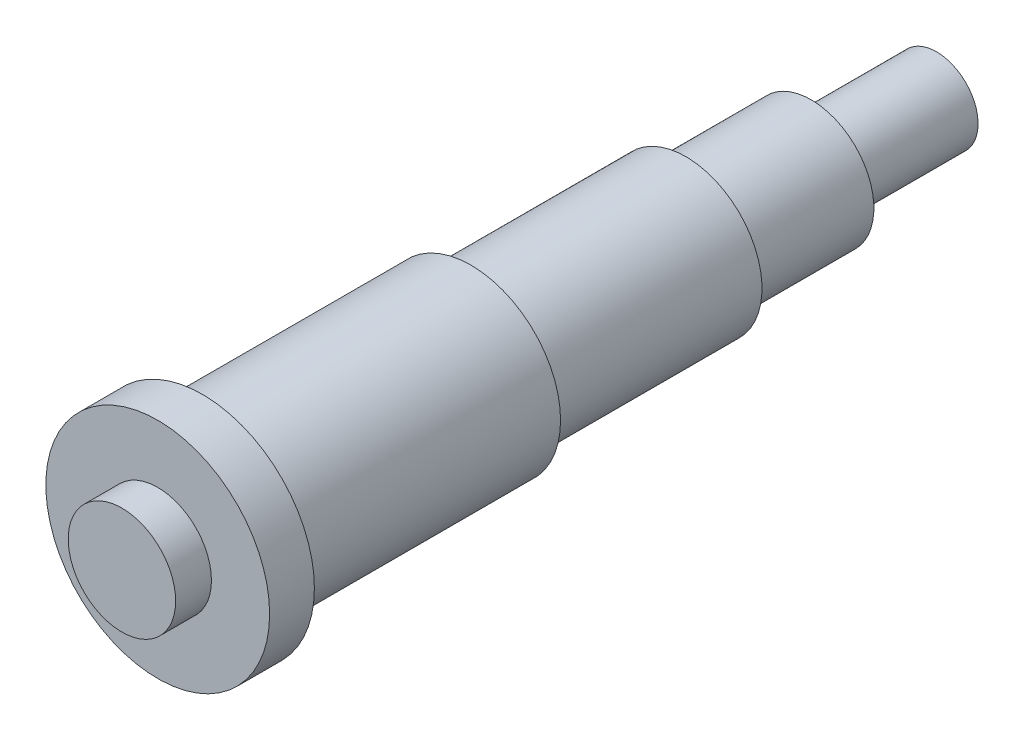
from build123d import *

# Parameters (mm, degrees)
SKETCH1_R           = 12.5
BOSS_EXTRUDE1_DEPTH = 5
SKETCH2_R           = 6
BOSS_EXTRUDE2_DEPTH = 4
SKETCH3_R           = 10
BOSS_EXTRUDE3_DEPTH = 30
SKETCH4_R           = 8.5
BOSS_EXTRUDE4_DEPTH = 24
SKETCH5_R           = 7
BOSS_EXTRUDE5_DEPTH = 14
SKETCH6_R           = 4.640369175
BOSS_EXTRUDE6_DEPTH = 14


with BuildPart() as part:
    # Sketch1 → Boss-Extrude1 (new body)
    with BuildSketch(Plane.XY):
        Circle(SKETCH1_R)
    extrude(amount=BOSS_EXTRUDE1_DEPTH)

    # Sketch2 → Boss-Extrude2 (add)
    with BuildSketch(Plane.XY.offset(5)):
        Circle(SKETCH2_R)
    extrude(amount=BOSS_EXTRUDE2_DEPTH)

    # Sketch3 → Boss-Extrude3 (add)
    with BuildSketch(Plane(origin=(0, 0, 0), x_dir=(-1, 0, 0), z_dir=(0, 0, -1))):
        with Locations(Location((0, 0, 0), (0, 0, 180))):
            Circle(SKETCH3_R)
    extrude(amount=BOSS_EXTRUDE3_DEPTH)

    # Sketch4 → Boss-Extrude4 (add)
    with BuildSketch(Plane(origin=(0, 0, -30), x_dir=(-1, 0, 0), z_dir=(0, 0, -1))):
        Circle(SKETCH4_R)
    extrude(amount=BOSS_EXTRUDE4_DEPTH)

    # Sketch5 → Boss-Extrude5 (add)
    with BuildSketch(Plane(origin=(0, 0, -54), x_dir=(-1, 0, 0), z_dir=(0, 0, -1))):
        Circle(SKETCH5_R)
    extrude(amount=BOSS_EXTRUDE5_DEPTH)

    # Sketch6 → Boss-Extrude6 (add)
    with BuildSketch(Plane(origin=(0, 0, -68), x_dir=(-1, 0, 0), z_dir=(0, 0, -1))):
        Circle(SKETCH6_R)
    extrude(amount=BOSS_EXTRUDE6_DEPTH)


solid = part.part
